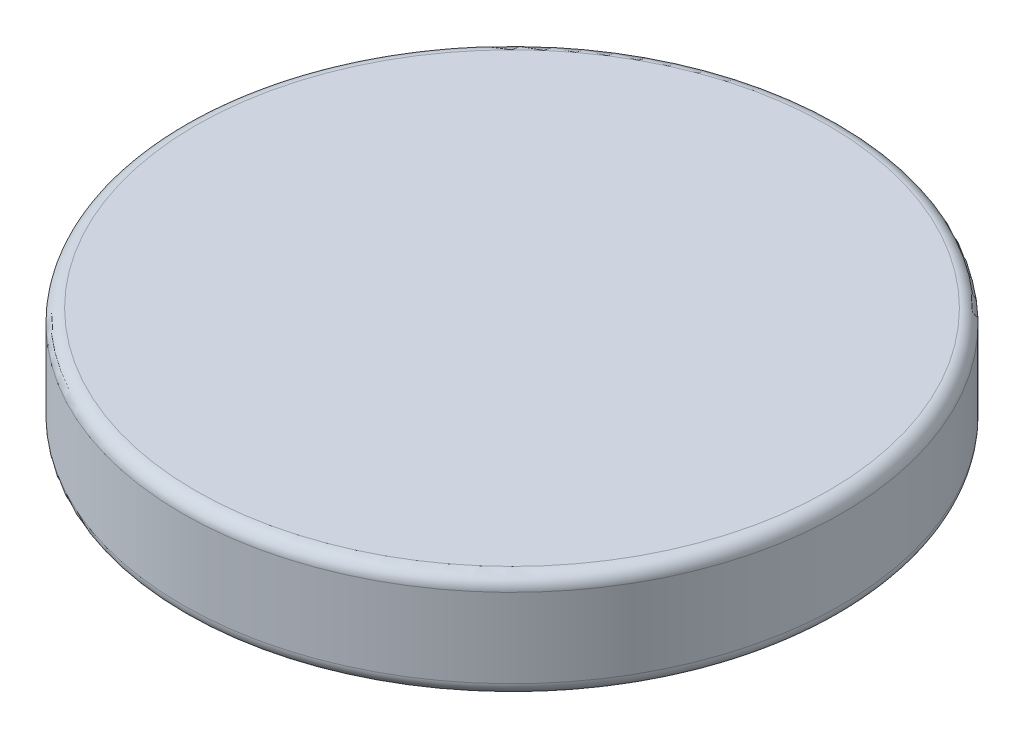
from build123d import *

# Parameters (mm, degrees)
SCHIZZO1_R                   = 12.5
ESTRUSIONE_ESTRUSIONE1_DEPTH = 4
RACCORDO1_R                  = 0.5
RACCORDO2_R                  = 0.5


with BuildPart() as part:
    # Schizzo1 → Estrusione-Estrusione1 (new body)
    with BuildSketch(Plane(origin=(0, 0, 0), x_dir=(1, 0, 0), z_dir=(0, 1, 0))):
        with Locations(Location((0, 0, 0), (0, 0, 270))):
            Circle(SCHIZZO1_R)
    extrude(amount=ESTRUSIONE_ESTRUSIONE1_DEPTH)

    # Raccordo1
    raccordo1_edges = [part.edges().sort_by_distance(p)[0] for p in [
        (0, 4, -12.5),
    ]]
    fillet(raccordo1_edges, radius=RACCORDO1_R)

    # Raccordo2
    raccordo2_edges = [part.edges().sort_by_distance(p)[0] for p in [
        (0, 0, -12.5),
    ]]
    fillet(raccordo2_edges, radius=RACCORDO2_R)


solid = part.part
